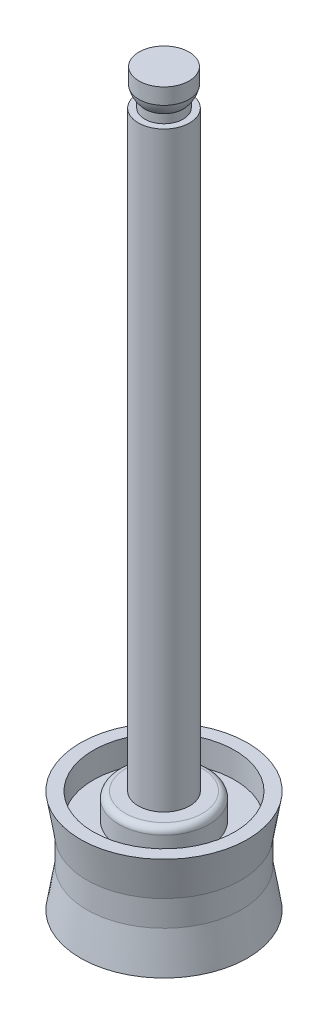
from build123d import *

# Parameters (mm, degrees)
SKETCH_1_R          = 6.5
EXTRUDE_1_DEPTH     = 8
SKETCH_2_R          = 2
EXTRUDE_2_DEPTH     = 46
SKETCH_6_R          = 5.5
SKETCH_6_R_2        = 3.5
CUT_EXTRUDE_1_DEPTH = 2
CUT_EXTRUDE_START   = -2
SKETCH_7_R          = 5.5
SKETCH_7_R_2        = 3.5
CUT_EXTRUDE_2_DEPTH = 2
FILLET_2_R          = 0.5


with BuildPart() as part:
    # Sketch 1 → Extrude 1 (new body)
    with BuildSketch(Plane(origin=(0, 0, 0), x_dir=(1, 0, 0), z_dir=(0, 1, 0))):
        with Locations(Location((0, 0, 0), (0, 0, 270))):
            Circle(SKETCH_1_R)
    extrude(amount=EXTRUDE_1_DEPTH)

    # Sketch 2 → Extrude 2 (add)
    with BuildSketch(Plane(origin=(0, 8, 0), x_dir=(1, 0, 0), z_dir=(0, 1, 0))):
        with Locations(Location((0, 0, 0), (0, 0, 270))):
            Circle(SKETCH_2_R)
    extrude(amount=EXTRUDE_2_DEPTH)

    # Sketch 4 → Revolve 1 (revolve)
    with BuildSketch(Plane.XY):
        with BuildLine():
            Line((0, 54), (0, 56))
            Line((0, 56), (0, 56.8))
            Line((0, 56.8), (1.95, 56.8))
            Line((1.95, 56.8), (1.95, 55.555590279))
            ThreePointArc((1.95, 55.555590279), (1.780042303, 55.088161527), (1.5, 54.677124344))
            Line((1.5, 54.677124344), (1.5, 54))
            Line((1.5, 54), (0, 54))
        make_face()
    revolve(axis=Axis((0, 54, 0), (0, 1, 0)))

    # Sketch 5 → Cut-Revolve 1 (revolve, cut)
    with BuildSketch(Plane.XY, mode=Mode.PRIVATE) as cut_revolve_1_sk:
        Polygon((-6.5, 8), (-6.5, 5), (-6.5, 3), (-6.5, 0), (-6, 3), (-6, 5), align=None)
    revolve(cut_revolve_1_sk.sketch.rotate(Axis((0, 0, 0), (0, 1, 0)), 270), axis=Axis((0, 0, 0), (0, 1, 0)), mode=Mode.SUBTRACT)

    # Sketch 6 → Cut-Extrude 1 (cut)
    with BuildSketch(Plane.XZ):
        with Locations(Location((0, 0, 0), (0, 0, 270))):
            Circle(SKETCH_6_R)
        with Locations(Location((0, 0, 0), (0, 0, 270))):
            Circle(SKETCH_6_R_2, mode=Mode.SUBTRACT)
    extrude(amount=-CUT_EXTRUDE_1_DEPTH, mode=Mode.SUBTRACT)

    # Sketch 7 → Cut-Extrude 2 (cut)
    with BuildSketch(Plane(origin=(0, 8, 0), x_dir=(1, 0, 0), z_dir=(0, 1, 0)).offset(CUT_EXTRUDE_START)):
        with Locations(Location((0, 0, 0), (0, 0, 90))):
            Circle(SKETCH_7_R)
        with Locations(Location((0, 0, 0), (0, 0, 90))):
            Circle(SKETCH_7_R_2, mode=Mode.SUBTRACT)
    extrude(amount=CUT_EXTRUDE_2_DEPTH, mode=Mode.SUBTRACT)

    # Fillet 2
    fillet_2_edges = [part.edges().sort_by_distance(p)[0] for p in [
        (0, 0, 3.5),
        (0, 8, 3.5),
    ]]
    fillet(fillet_2_edges, radius=FILLET_2_R)


solid = part.part
